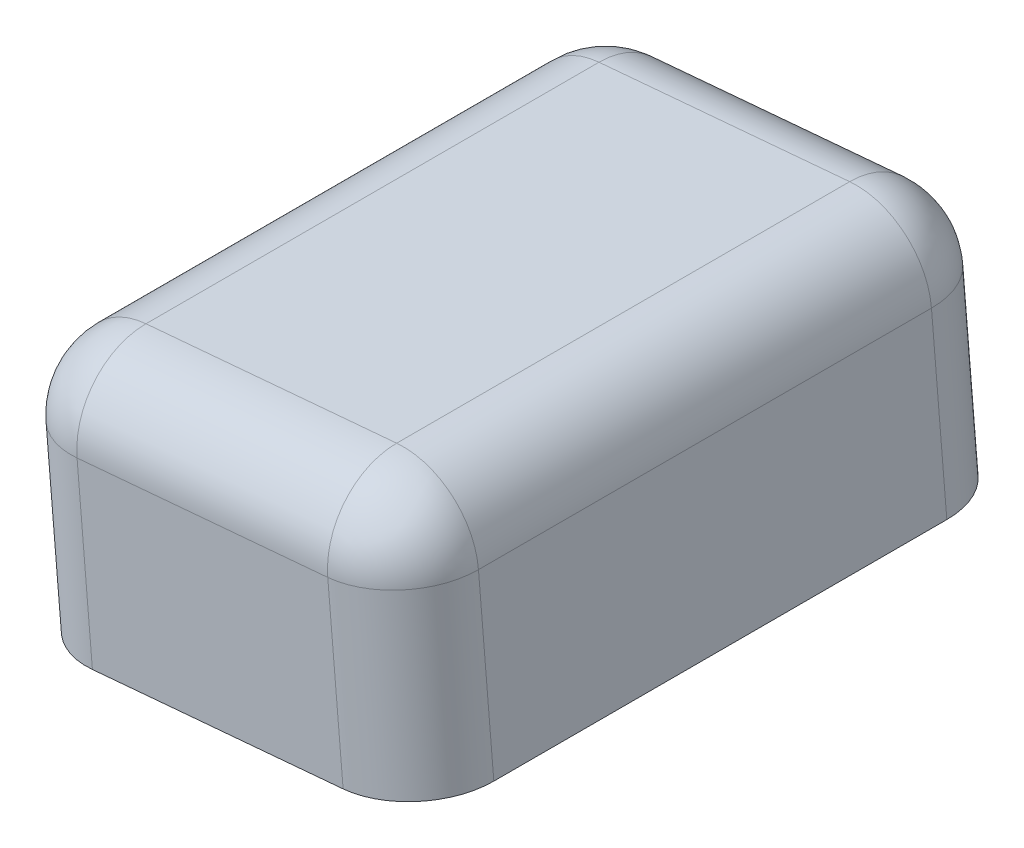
ISO-10303-21;
HEADER;
FILE_DESCRIPTION(('STEP AP214'),'2;1');
FILE_NAME('part.step','',(''),(''),'','','');
FILE_SCHEMA(('AUTOMOTIVE_DESIGN { 1 0 10303 214 1 1 1 1 }'));
ENDSEC;
DATA;
#1=APPLICATION_CONTEXT('core data for automotive mechanical design processes');
#2=APPLICATION_PROTOCOL_DEFINITION('international standard','automotive_design',2000,#1);
#3=PRODUCT_CONTEXT('',#1,'mechanical');
#4=PRODUCT('Part','Part','',(#3));
#5=PRODUCT_RELATED_PRODUCT_CATEGORY('part','',(#4));
#6=PRODUCT_DEFINITION_FORMATION('','',#4);
#7=PRODUCT_DEFINITION_CONTEXT('part definition',#1,'design');
#8=PRODUCT_DEFINITION('design','',#6,#7);
#9=PRODUCT_DEFINITION_SHAPE('','',#8);
#10=(LENGTH_UNIT() NAMED_UNIT(*) SI_UNIT(.MILLI.,.METRE.));
#11=(NAMED_UNIT(*) PLANE_ANGLE_UNIT() SI_UNIT($,.RADIAN.));
#12=(NAMED_UNIT(*) SI_UNIT($,.STERADIAN.) SOLID_ANGLE_UNIT());
#13=UNCERTAINTY_MEASURE_WITH_UNIT(LENGTH_MEASURE(1.E-05),#10,'distance_accuracy_value','');
#14=(GEOMETRIC_REPRESENTATION_CONTEXT(3) GLOBAL_UNCERTAINTY_ASSIGNED_CONTEXT((#13)) GLOBAL_UNIT_ASSIGNED_CONTEXT((#10,
#11,#12)) REPRESENTATION_CONTEXT('',''));
#15=CARTESIAN_POINT('',(0.,0.,0.));
#16=DIRECTION('',(0.,0.,1.));
#17=DIRECTION('',(1.,0.,0.));
#18=AXIS2_PLACEMENT_3D('',#15,#16,#17);
#19=CARTESIAN_POINT('',(-0.435778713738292,4.98097349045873,0.));
#20=DIRECTION('',(-0.996194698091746,-0.0871557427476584,0.));
#21=DIRECTION('',(0.0871557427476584,-0.996194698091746,0.));
#22=AXIS2_PLACEMENT_3D('',#19,#20,#21);
#23=PLANE('',#22);
#24=DIRECTION('',(0.,0.,-1.));
#25=VECTOR('',#24,1.);
#26=CARTESIAN_POINT('',(0.,0.,0.));
#27=LINE('',#26,#25);
#28=CARTESIAN_POINT('',(0.,0.,10.5));
#29=VERTEX_POINT('',#28);
#30=CARTESIAN_POINT('',(0.,0.,1.5));
#31=VERTEX_POINT('',#30);
#32=EDGE_CURVE('E133',#29,#31,#27,.T.);
#33=ORIENTED_EDGE('',*,*,#32,.T.);
#34=DIRECTION('',(0.0871557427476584,-0.996194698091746,0.));
#35=VECTOR('',#34,1.);
#36=CARTESIAN_POINT('',(-0.435778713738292,4.98097349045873,1.5));
#37=LINE('',#36,#35);
#38=CARTESIAN_POINT('',(-0.305045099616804,3.48668144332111,1.5));
#39=VERTEX_POINT('',#38);
#40=EDGE_CURVE('E150',#31,#39,#37,.F.);
#41=ORIENTED_EDGE('',*,*,#40,.T.);
#42=DIRECTION('',(0.,0.,-1.));
#43=VECTOR('',#42,1.);
#44=CARTESIAN_POINT('',(-0.305045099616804,3.48668144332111,0.));
#45=LINE('',#44,#43);
#46=CARTESIAN_POINT('',(-0.305045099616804,3.48668144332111,10.5));
#47=VERTEX_POINT('',#46);
#48=EDGE_CURVE('E146',#39,#47,#45,.F.);
#49=ORIENTED_EDGE('',*,*,#48,.T.);
#50=DIRECTION('',(0.0871557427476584,-0.996194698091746,0.));
#51=VECTOR('',#50,1.);
#52=CARTESIAN_POINT('',(-0.435778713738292,4.98097349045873,10.5));
#53=LINE('',#52,#51);
#54=EDGE_CURVE('E148',#47,#29,#53,.T.);
#55=ORIENTED_EDGE('',*,*,#54,.T.);
#56=EDGE_LOOP('',(#33,#41,#49,#55));
#57=FACE_BOUND('',#56,.T.);
#58=ADVANCED_FACE('F27',(#57),#23,.F.);
#59=CARTESIAN_POINT('',(-0.435778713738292,4.98097349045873,0.));
#60=DIRECTION('',(0.,0.,1.));
#61=DIRECTION('',(1.,0.,0.));
#62=AXIS2_PLACEMENT_3D('',#59,#60,#61);
#63=PLANE('',#62);
#64=DIRECTION('',(-0.996194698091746,-0.0871557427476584,0.));
#65=VECTOR('',#64,1.);
#66=CARTESIAN_POINT('',(0.,0.,0.));
#67=LINE('',#66,#65);
#68=CARTESIAN_POINT('',(-1.49429204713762,-0.130733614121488,0.));
#69=VERTEX_POINT('',#68);
#70=CARTESIAN_POINT('',(-6.47526553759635,-0.566512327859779,0.));
#71=VERTEX_POINT('',#70);
#72=EDGE_CURVE('E129',#69,#71,#67,.T.);
#73=ORIENTED_EDGE('',*,*,#72,.T.);
#74=DIRECTION('',(0.0871557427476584,-0.996194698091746,0.));
#75=VECTOR('',#74,1.);
#76=CARTESIAN_POINT('',(-6.91104425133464,4.41446116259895,0.));
#77=LINE('',#76,#75);
#78=CARTESIAN_POINT('',(-6.78031063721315,2.92016911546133,0.));
#79=VERTEX_POINT('',#78);
#80=EDGE_CURVE('E105',#71,#79,#77,.F.);
#81=ORIENTED_EDGE('',*,*,#80,.T.);
#82=DIRECTION('',(-0.996194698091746,-0.0871557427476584,0.));
#83=VECTOR('',#82,1.);
#84=CARTESIAN_POINT('',(-0.305045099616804,3.48668144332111,0.));
#85=LINE('',#84,#83);
#86=CARTESIAN_POINT('',(-1.79933714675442,3.35594782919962,0.));
#87=VERTEX_POINT('',#86);
#88=EDGE_CURVE('E110',#79,#87,#85,.F.);
#89=ORIENTED_EDGE('',*,*,#88,.T.);
#90=DIRECTION('',(0.0871557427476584,-0.996194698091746,0.));
#91=VECTOR('',#90,1.);
#92=CARTESIAN_POINT('',(-1.93007076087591,4.85023987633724,0.));
#93=LINE('',#92,#91);
#94=EDGE_CURVE('E143',#87,#69,#93,.T.);
#95=ORIENTED_EDGE('',*,*,#94,.T.);
#96=EDGE_LOOP('',(#73,#81,#89,#95));
#97=FACE_BOUND('',#96,.T.);
#98=ADVANCED_FACE('F253',(#97),#63,.F.);
#99=CARTESIAN_POINT('',(-8.40533629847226,4.28372754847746,0.));
#100=DIRECTION('',(0.996194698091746,0.0871557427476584,0.));
#101=DIRECTION('',(-0.0871557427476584,0.996194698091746,0.));
#102=AXIS2_PLACEMENT_3D('',#99,#100,#101);
#103=PLANE('',#102);
#104=DIRECTION('',(0.,0.,1.));
#105=VECTOR('',#104,1.);
#106=CARTESIAN_POINT('',(-8.27460268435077,2.78943550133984,0.));
#107=LINE('',#106,#105);
#108=CARTESIAN_POINT('',(-8.27460268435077,2.78943550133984,10.5));
#109=VERTEX_POINT('',#108);
#110=CARTESIAN_POINT('',(-8.27460268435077,2.78943550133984,1.5));
#111=VERTEX_POINT('',#110);
#112=EDGE_CURVE('E119',#109,#111,#107,.F.);
#113=ORIENTED_EDGE('',*,*,#112,.T.);
#114=DIRECTION('',(0.0871557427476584,-0.996194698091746,0.));
#115=VECTOR('',#114,1.);
#116=CARTESIAN_POINT('',(-8.40533629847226,4.28372754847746,1.5));
#117=LINE('',#116,#115);
#118=CARTESIAN_POINT('',(-7.96955758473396,-0.697245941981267,1.5));
#119=VERTEX_POINT('',#118);
#120=EDGE_CURVE('E104',#111,#119,#117,.T.);
#121=ORIENTED_EDGE('',*,*,#120,.T.);
#122=DIRECTION('',(0.,0.,1.));
#123=VECTOR('',#122,1.);
#124=CARTESIAN_POINT('',(-7.96955758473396,-0.697245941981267,0.));
#125=LINE('',#124,#123);
#126=CARTESIAN_POINT('',(-7.96955758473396,-0.697245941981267,10.5));
#127=VERTEX_POINT('',#126);
#128=EDGE_CURVE('E116',#119,#127,#125,.T.);
#129=ORIENTED_EDGE('',*,*,#128,.T.);
#130=DIRECTION('',(0.0871557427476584,-0.996194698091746,0.));
#131=VECTOR('',#130,1.);
#132=CARTESIAN_POINT('',(-8.40533629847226,4.28372754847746,10.5));
#133=LINE('',#132,#131);
#134=EDGE_CURVE('E122',#127,#109,#133,.F.);
#135=ORIENTED_EDGE('',*,*,#134,.T.);
#136=EDGE_LOOP('',(#113,#121,#129,#135));
#137=FACE_BOUND('',#136,.T.);
#138=ADVANCED_FACE('F115',(#137),#103,.F.);
#139=CARTESIAN_POINT('',(-0.435778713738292,4.98097349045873,12.));
#140=DIRECTION('',(0.,0.,-1.));
#141=DIRECTION('',(-1.,0.,0.));
#142=AXIS2_PLACEMENT_3D('',#139,#140,#141);
#143=PLANE('',#142);
#144=DIRECTION('',(0.996194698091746,0.0871557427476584,0.));
#145=VECTOR('',#144,1.);
#146=CARTESIAN_POINT('',(-0.305045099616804,3.48668144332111,12.));
#147=LINE('',#146,#145);
#148=CARTESIAN_POINT('',(-1.79933714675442,3.35594782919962,12.));
#149=VERTEX_POINT('',#148);
#150=CARTESIAN_POINT('',(-6.78031063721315,2.92016911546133,12.));
#151=VERTEX_POINT('',#150);
#152=EDGE_CURVE('E152',#149,#151,#147,.F.);
#153=ORIENTED_EDGE('',*,*,#152,.T.);
#154=DIRECTION('',(0.0871557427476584,-0.996194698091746,0.));
#155=VECTOR('',#154,1.);
#156=CARTESIAN_POINT('',(-6.91104425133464,4.41446116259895,12.));
#157=LINE('',#156,#155);
#158=CARTESIAN_POINT('',(-6.47526553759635,-0.566512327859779,12.));
#159=VERTEX_POINT('',#158);
#160=EDGE_CURVE('E156',#151,#159,#157,.T.);
#161=ORIENTED_EDGE('',*,*,#160,.T.);
#162=DIRECTION('',(0.996194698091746,0.0871557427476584,0.));
#163=VECTOR('',#162,1.);
#164=CARTESIAN_POINT('',(0.,0.,12.));
#165=LINE('',#164,#163);
#166=CARTESIAN_POINT('',(-1.49429204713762,-0.130733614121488,12.));
#167=VERTEX_POINT('',#166);
#168=EDGE_CURVE('E128',#159,#167,#165,.T.);
#169=ORIENTED_EDGE('',*,*,#168,.T.);
#170=DIRECTION('',(0.0871557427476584,-0.996194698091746,0.));
#171=VECTOR('',#170,1.);
#172=CARTESIAN_POINT('',(-1.93007076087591,4.85023987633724,12.));
#173=LINE('',#172,#171);
#174=EDGE_CURVE('E154',#167,#149,#173,.F.);
#175=ORIENTED_EDGE('',*,*,#174,.T.);
#176=EDGE_LOOP('',(#153,#161,#169,#175));
#177=FACE_BOUND('',#176,.T.);
#178=ADVANCED_FACE('F238',(#177),#143,.F.);
#179=CARTESIAN_POINT('',(-0.435778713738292,4.98097349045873,12.));
#180=DIRECTION('',(0.0871557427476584,-0.996194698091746,0.));
#181=DIRECTION('',(0.996194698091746,0.0871557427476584,0.));
#182=AXIS2_PLACEMENT_3D('',#179,#180,#181);
#183=PLANE('',#182);
#184=DIRECTION('',(0.996194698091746,0.0871557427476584,0.));
#185=VECTOR('',#184,1.);
#186=CARTESIAN_POINT('',(-0.435778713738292,4.98097349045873,10.5));
#187=LINE('',#186,#185);
#188=CARTESIAN_POINT('',(-6.91104425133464,4.41446116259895,10.5));
#189=VERTEX_POINT('',#188);
#190=CARTESIAN_POINT('',(-1.93007076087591,4.85023987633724,10.5));
#191=VERTEX_POINT('',#190);
#192=EDGE_CURVE('E34',#189,#191,#187,.T.);
#193=ORIENTED_EDGE('',*,*,#192,.T.);
#194=DIRECTION('',(0.,0.,-1.));
#195=VECTOR('',#194,1.);
#196=CARTESIAN_POINT('',(-1.93007076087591,4.85023987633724,12.));
#197=LINE('',#196,#195);
#198=CARTESIAN_POINT('',(-1.93007076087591,4.85023987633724,1.5));
#199=VERTEX_POINT('',#198);
#200=EDGE_CURVE('E11',#191,#199,#197,.T.);
#201=ORIENTED_EDGE('',*,*,#200,.T.);
#202=DIRECTION('',(-0.996194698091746,-0.0871557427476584,0.));
#203=VECTOR('',#202,1.);
#204=CARTESIAN_POINT('',(-0.435778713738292,4.98097349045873,1.5));
#205=LINE('',#204,#203);
#206=CARTESIAN_POINT('',(-6.91104425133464,4.41446116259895,1.5));
#207=VERTEX_POINT('',#206);
#208=EDGE_CURVE('E158',#199,#207,#205,.T.);
#209=ORIENTED_EDGE('',*,*,#208,.T.);
#210=DIRECTION('',(0.,0.,1.));
#211=VECTOR('',#210,1.);
#212=CARTESIAN_POINT('',(-6.91104425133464,4.41446116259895,12.));
#213=LINE('',#212,#211);
#214=EDGE_CURVE('E44',#207,#189,#213,.T.);
#215=ORIENTED_EDGE('',*,*,#214,.T.);
#216=EDGE_LOOP('',(#193,#201,#209,#215));
#217=FACE_BOUND('',#216,.T.);
#218=ADVANCED_FACE('F160',(#217),#183,.F.);
#219=CARTESIAN_POINT('',(0.,0.,12.));
#220=DIRECTION('',(0.0871557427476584,-0.996194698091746,0.));
#221=DIRECTION('',(0.996194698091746,0.0871557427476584,0.));
#222=AXIS2_PLACEMENT_3D('',#219,#220,#221);
#223=PLANE('',#222);
#224=ORIENTED_EDGE('',*,*,#128,.F.);
#225=CARTESIAN_POINT('',(-6.47526553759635,-0.566512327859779,1.5));
#226=DIRECTION('',(0.0871557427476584,-0.996194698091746,0.));
#227=DIRECTION('',(0.996194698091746,0.0871557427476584,0.));
#228=AXIS2_PLACEMENT_3D('',#225,#226,#227);
#229=CIRCLE('',#228,1.5);
#230=EDGE_CURVE('E100',#119,#71,#229,.T.);
#231=ORIENTED_EDGE('',*,*,#230,.T.);
#232=ORIENTED_EDGE('',*,*,#72,.F.);
#233=CARTESIAN_POINT('',(-1.49429204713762,-0.130733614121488,1.5));
#234=DIRECTION('',(0.0871557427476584,-0.996194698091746,0.));
#235=DIRECTION('',(0.996194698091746,0.0871557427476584,0.));
#236=AXIS2_PLACEMENT_3D('',#233,#234,#235);
#237=CIRCLE('',#236,1.5);
#238=EDGE_CURVE('E111',#69,#31,#237,.T.);
#239=ORIENTED_EDGE('',*,*,#238,.T.);
#240=ORIENTED_EDGE('',*,*,#32,.F.);
#241=CARTESIAN_POINT('',(-1.49429204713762,-0.130733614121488,10.5));
#242=DIRECTION('',(0.0871557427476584,-0.996194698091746,0.));
#243=DIRECTION('',(0.996194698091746,0.0871557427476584,0.));
#244=AXIS2_PLACEMENT_3D('',#241,#242,#243);
#245=CIRCLE('',#244,1.5);
#246=EDGE_CURVE('E121',#29,#167,#245,.T.);
#247=ORIENTED_EDGE('',*,*,#246,.T.);
#248=ORIENTED_EDGE('',*,*,#168,.F.);
#249=CARTESIAN_POINT('',(-6.47526553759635,-0.566512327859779,10.5));
#250=DIRECTION('',(0.0871557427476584,-0.996194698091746,0.));
#251=DIRECTION('',(0.996194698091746,0.0871557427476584,0.));
#252=AXIS2_PLACEMENT_3D('',#249,#250,#251);
#253=CIRCLE('',#252,1.5);
#254=EDGE_CURVE('E127',#159,#127,#253,.T.);
#255=ORIENTED_EDGE('',*,*,#254,.T.);
#256=EDGE_LOOP('',(#224,#231,#232,#239,#240,#247,#248,#255));
#257=FACE_BOUND('',#256,.T.);
#258=ADVANCED_FACE('F124',(#257),#223,.T.);
#259=CARTESIAN_POINT('',(-1.93007076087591,4.85023987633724,10.5));
#260=DIRECTION('',(0.0871557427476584,-0.996194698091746,0.));
#261=DIRECTION('',(0.996194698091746,0.0871557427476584,0.));
#262=AXIS2_PLACEMENT_3D('',#259,#260,#261);
#263=CYLINDRICAL_SURFACE('',#262,1.5);
#264=CARTESIAN_POINT('',(-1.79933714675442,3.35594782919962,10.5));
#265=DIRECTION('',(-0.0871557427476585,0.996194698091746,0.));
#266=DIRECTION('',(-0.996194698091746,-0.0871557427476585,0.));
#267=AXIS2_PLACEMENT_3D('',#264,#265,#266);
#268=CIRCLE('',#267,1.5);
#269=EDGE_CURVE('E205',#149,#47,#268,.T.);
#270=ORIENTED_EDGE('',*,*,#269,.F.);
#271=ORIENTED_EDGE('',*,*,#174,.F.);
#272=ORIENTED_EDGE('',*,*,#246,.F.);
#273=ORIENTED_EDGE('',*,*,#54,.F.);
#274=EDGE_LOOP('',(#270,#271,#272,#273));
#275=FACE_BOUND('',#274,.T.);
#276=ADVANCED_FACE('F227',(#275),#263,.T.);
#277=CARTESIAN_POINT('',(-1.79933714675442,3.35594782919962,10.5));
#278=DIRECTION('',(0.,0.,1.));
#279=DIRECTION('',(1.,0.,0.));
#280=AXIS2_PLACEMENT_3D('',#277,#278,#279);
#281=SPHERICAL_SURFACE('',#280,1.5);
#282=CARTESIAN_POINT('',(-1.79933714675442,3.35594782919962,10.5));
#283=DIRECTION('',(0.996194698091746,0.0871557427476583,0.));
#284=DIRECTION('',(-0.0871557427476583,0.996194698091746,0.));
#285=AXIS2_PLACEMENT_3D('',#282,#283,#284);
#286=CIRCLE('',#285,1.5);
#287=EDGE_CURVE('E200',#149,#191,#286,.F.);
#288=ORIENTED_EDGE('',*,*,#287,.F.);
#289=ORIENTED_EDGE('',*,*,#269,.T.);
#290=CARTESIAN_POINT('',(-1.79933714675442,3.35594782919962,10.5));
#291=DIRECTION('',(0.,0.,1.));
#292=DIRECTION('',(1.,0.,0.));
#293=AXIS2_PLACEMENT_3D('',#290,#291,#292);
#294=CIRCLE('',#293,1.5);
#295=EDGE_CURVE('E202',#191,#47,#294,.F.);
#296=ORIENTED_EDGE('',*,*,#295,.F.);
#297=EDGE_LOOP('',(#288,#289,#296));
#298=FACE_BOUND('',#297,.T.);
#299=ADVANCED_FACE('F231',(#298),#281,.T.);
#300=CARTESIAN_POINT('',(-1.93007076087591,4.85023987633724,1.5));
#301=DIRECTION('',(0.0871557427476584,-0.996194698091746,0.));
#302=DIRECTION('',(0.996194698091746,0.0871557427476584,0.));
#303=AXIS2_PLACEMENT_3D('',#300,#301,#302);
#304=CYLINDRICAL_SURFACE('',#303,1.5);
#305=ORIENTED_EDGE('',*,*,#238,.F.);
#306=ORIENTED_EDGE('',*,*,#94,.F.);
#307=CARTESIAN_POINT('',(-1.79933714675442,3.35594782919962,1.5));
#308=DIRECTION('',(-0.0871557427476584,0.996194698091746,0.));
#309=DIRECTION('',(-0.996194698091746,-0.0871557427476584,0.));
#310=AXIS2_PLACEMENT_3D('',#307,#308,#309);
#311=CIRCLE('',#310,1.5);
#312=EDGE_CURVE('E197',#39,#87,#311,.T.);
#313=ORIENTED_EDGE('',*,*,#312,.F.);
#314=ORIENTED_EDGE('',*,*,#40,.F.);
#315=EDGE_LOOP('',(#305,#306,#313,#314));
#316=FACE_BOUND('',#315,.T.);
#317=ADVANCED_FACE('F217',(#316),#304,.T.);
#318=CARTESIAN_POINT('',(-1.79933714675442,3.35594782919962,12.));
#319=DIRECTION('',(0.,0.,-1.));
#320=DIRECTION('',(-1.,0.,0.));
#321=AXIS2_PLACEMENT_3D('',#318,#319,#320);
#322=CYLINDRICAL_SURFACE('',#321,1.5);
#323=ORIENTED_EDGE('',*,*,#295,.T.);
#324=ORIENTED_EDGE('',*,*,#48,.F.);
#325=CARTESIAN_POINT('',(-1.79933714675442,3.35594782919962,1.5));
#326=DIRECTION('',(0.,0.,-1.));
#327=DIRECTION('',(-1.,0.,0.));
#328=AXIS2_PLACEMENT_3D('',#325,#326,#327);
#329=CIRCLE('',#328,1.5);
#330=EDGE_CURVE('E194',#199,#39,#329,.T.);
#331=ORIENTED_EDGE('',*,*,#330,.F.);
#332=ORIENTED_EDGE('',*,*,#200,.F.);
#333=EDGE_LOOP('',(#323,#324,#331,#332));
#334=FACE_BOUND('',#333,.T.);
#335=ADVANCED_FACE('F223',(#334),#322,.T.);
#336=CARTESIAN_POINT('',(-0.305045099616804,3.48668144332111,10.5));
#337=DIRECTION('',(0.996194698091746,0.0871557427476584,0.));
#338=DIRECTION('',(-0.0871557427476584,0.996194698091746,0.));
#339=AXIS2_PLACEMENT_3D('',#336,#337,#338);
#340=CYLINDRICAL_SURFACE('',#339,1.5);
#341=ORIENTED_EDGE('',*,*,#287,.T.);
#342=ORIENTED_EDGE('',*,*,#192,.F.);
#343=CARTESIAN_POINT('',(-6.78031063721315,2.92016911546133,10.5));
#344=DIRECTION('',(-0.996194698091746,-0.0871557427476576,0.));
#345=DIRECTION('',(0.0871557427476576,-0.996194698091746,0.));
#346=AXIS2_PLACEMENT_3D('',#343,#344,#345);
#347=CIRCLE('',#346,1.5);
#348=EDGE_CURVE('E191',#151,#189,#347,.T.);
#349=ORIENTED_EDGE('',*,*,#348,.F.);
#350=ORIENTED_EDGE('',*,*,#152,.F.);
#351=EDGE_LOOP('',(#341,#342,#349,#350));
#352=FACE_BOUND('',#351,.T.);
#353=ADVANCED_FACE('F235',(#352),#340,.T.);
#354=CARTESIAN_POINT('',(-6.91104425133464,4.41446116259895,10.5));
#355=DIRECTION('',(0.0871557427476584,-0.996194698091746,0.));
#356=DIRECTION('',(0.996194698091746,0.0871557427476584,0.));
#357=AXIS2_PLACEMENT_3D('',#354,#355,#356);
#358=CYLINDRICAL_SURFACE('',#357,1.5);
#359=ORIENTED_EDGE('',*,*,#254,.F.);
#360=ORIENTED_EDGE('',*,*,#160,.F.);
#361=CARTESIAN_POINT('',(-6.78031063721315,2.92016911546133,10.5));
#362=DIRECTION('',(-0.0871557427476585,0.996194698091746,0.));
#363=DIRECTION('',(-0.996194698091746,-0.0871557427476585,0.));
#364=AXIS2_PLACEMENT_3D('',#361,#362,#363);
#365=CIRCLE('',#364,1.5);
#366=EDGE_CURVE('E188',#109,#151,#365,.T.);
#367=ORIENTED_EDGE('',*,*,#366,.F.);
#368=ORIENTED_EDGE('',*,*,#134,.F.);
#369=EDGE_LOOP('',(#359,#360,#367,#368));
#370=FACE_BOUND('',#369,.T.);
#371=ADVANCED_FACE('F241',(#370),#358,.T.);
#372=CARTESIAN_POINT('',(-1.79933714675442,3.35594782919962,1.5));
#373=DIRECTION('',(0.,0.,1.));
#374=DIRECTION('',(1.,0.,0.));
#375=AXIS2_PLACEMENT_3D('',#372,#373,#374);
#376=SPHERICAL_SURFACE('',#375,1.5);
#377=ORIENTED_EDGE('',*,*,#330,.T.);
#378=ORIENTED_EDGE('',*,*,#312,.T.);
#379=CARTESIAN_POINT('',(-1.79933714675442,3.35594782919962,1.5));
#380=DIRECTION('',(0.996194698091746,0.0871557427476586,0.));
#381=DIRECTION('',(-0.0871557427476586,0.996194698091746,0.));
#382=AXIS2_PLACEMENT_3D('',#379,#380,#381);
#383=CIRCLE('',#382,1.5);
#384=EDGE_CURVE('E186',#199,#87,#383,.F.);
#385=ORIENTED_EDGE('',*,*,#384,.F.);
#386=EDGE_LOOP('',(#377,#378,#385));
#387=FACE_BOUND('',#386,.T.);
#388=ADVANCED_FACE('F221',(#387),#376,.T.);
#389=CARTESIAN_POINT('',(-6.78031063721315,2.92016911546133,10.5));
#390=DIRECTION('',(0.,0.,1.));
#391=DIRECTION('',(1.,0.,0.));
#392=AXIS2_PLACEMENT_3D('',#389,#390,#391);
#393=SPHERICAL_SURFACE('',#392,1.5);
#394=ORIENTED_EDGE('',*,*,#366,.T.);
#395=ORIENTED_EDGE('',*,*,#348,.T.);
#396=CARTESIAN_POINT('',(-6.78031063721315,2.92016911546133,10.5));
#397=DIRECTION('',(0.,0.,1.));
#398=DIRECTION('',(1.,0.,0.));
#399=AXIS2_PLACEMENT_3D('',#396,#397,#398);
#400=CIRCLE('',#399,1.5);
#401=EDGE_CURVE('E173',#109,#189,#400,.F.);
#402=ORIENTED_EDGE('',*,*,#401,.F.);
#403=EDGE_LOOP('',(#394,#395,#402));
#404=FACE_BOUND('',#403,.T.);
#405=ADVANCED_FACE('F243',(#404),#393,.T.);
#406=CARTESIAN_POINT('',(-0.305045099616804,3.48668144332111,1.5));
#407=DIRECTION('',(-0.996194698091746,-0.0871557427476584,0.));
#408=DIRECTION('',(0.0871557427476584,-0.996194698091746,0.));
#409=AXIS2_PLACEMENT_3D('',#406,#407,#408);
#410=CYLINDRICAL_SURFACE('',#409,1.5);
#411=ORIENTED_EDGE('',*,*,#384,.T.);
#412=ORIENTED_EDGE('',*,*,#88,.F.);
#413=CARTESIAN_POINT('',(-6.78031063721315,2.92016911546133,1.5));
#414=DIRECTION('',(-0.996194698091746,-0.0871557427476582,0.));
#415=DIRECTION('',(0.0871557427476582,-0.996194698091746,0.));
#416=AXIS2_PLACEMENT_3D('',#413,#414,#415);
#417=CIRCLE('',#416,1.5);
#418=EDGE_CURVE('E176',#207,#79,#417,.T.);
#419=ORIENTED_EDGE('',*,*,#418,.F.);
#420=ORIENTED_EDGE('',*,*,#208,.F.);
#421=EDGE_LOOP('',(#411,#412,#419,#420));
#422=FACE_BOUND('',#421,.T.);
#423=ADVANCED_FACE('F177',(#422),#410,.T.);
#424=CARTESIAN_POINT('',(-6.78031063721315,2.92016911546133,12.));
#425=DIRECTION('',(0.,0.,1.));
#426=DIRECTION('',(1.,0.,0.));
#427=AXIS2_PLACEMENT_3D('',#424,#425,#426);
#428=CYLINDRICAL_SURFACE('',#427,1.5);
#429=ORIENTED_EDGE('',*,*,#401,.T.);
#430=ORIENTED_EDGE('',*,*,#214,.F.);
#431=CARTESIAN_POINT('',(-6.78031063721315,2.92016911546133,1.5));
#432=DIRECTION('',(0.,0.,-1.));
#433=DIRECTION('',(0.,1.,0.));
#434=AXIS2_PLACEMENT_3D('',#431,#432,#433);
#435=CIRCLE('',#434,1.5);
#436=EDGE_CURVE('E170',#111,#207,#435,.T.);
#437=ORIENTED_EDGE('',*,*,#436,.F.);
#438=ORIENTED_EDGE('',*,*,#112,.F.);
#439=EDGE_LOOP('',(#429,#430,#437,#438));
#440=FACE_BOUND('',#439,.T.);
#441=ADVANCED_FACE('F168',(#440),#428,.T.);
#442=CARTESIAN_POINT('',(-6.78031063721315,2.92016911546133,1.5));
#443=DIRECTION('',(0.,0.,1.));
#444=DIRECTION('',(1.,0.,0.));
#445=AXIS2_PLACEMENT_3D('',#442,#443,#444);
#446=SPHERICAL_SURFACE('',#445,1.5);
#447=ORIENTED_EDGE('',*,*,#436,.T.);
#448=ORIENTED_EDGE('',*,*,#418,.T.);
#449=CARTESIAN_POINT('',(-6.78031063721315,2.92016911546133,1.5));
#450=DIRECTION('',(-0.0871557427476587,0.996194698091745,0.));
#451=DIRECTION('',(-0.996194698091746,-0.0871557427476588,0.));
#452=AXIS2_PLACEMENT_3D('',#449,#450,#451);
#453=CIRCLE('',#452,1.5);
#454=EDGE_CURVE('E181',#111,#79,#453,.F.);
#455=ORIENTED_EDGE('',*,*,#454,.F.);
#456=EDGE_LOOP('',(#447,#448,#455));
#457=FACE_BOUND('',#456,.T.);
#458=ADVANCED_FACE('F180',(#457),#446,.T.);
#459=CARTESIAN_POINT('',(-6.91104425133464,4.41446116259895,1.5));
#460=DIRECTION('',(0.0871557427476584,-0.996194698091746,0.));
#461=DIRECTION('',(0.996194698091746,0.0871557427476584,0.));
#462=AXIS2_PLACEMENT_3D('',#459,#460,#461);
#463=CYLINDRICAL_SURFACE('',#462,1.5);
#464=ORIENTED_EDGE('',*,*,#454,.T.);
#465=ORIENTED_EDGE('',*,*,#80,.F.);
#466=ORIENTED_EDGE('',*,*,#230,.F.);
#467=ORIENTED_EDGE('',*,*,#120,.F.);
#468=EDGE_LOOP('',(#464,#465,#466,#467));
#469=FACE_BOUND('',#468,.T.);
#470=ADVANCED_FACE('F103',(#469),#463,.T.);
#471=CLOSED_SHELL('',(#58,#98,#138,#178,#218,#258,#276,#299,#317,#335,#353,#371,#388,#405,#423,
#441,#458,#470));
#472=MANIFOLD_SOLID_BREP('B2',#471);
#473=ADVANCED_BREP_SHAPE_REPRESENTATION('',(#18,#472),#14);
#474=SHAPE_DEFINITION_REPRESENTATION(#9,#473);
ENDSEC;
END-ISO-10303-21;
